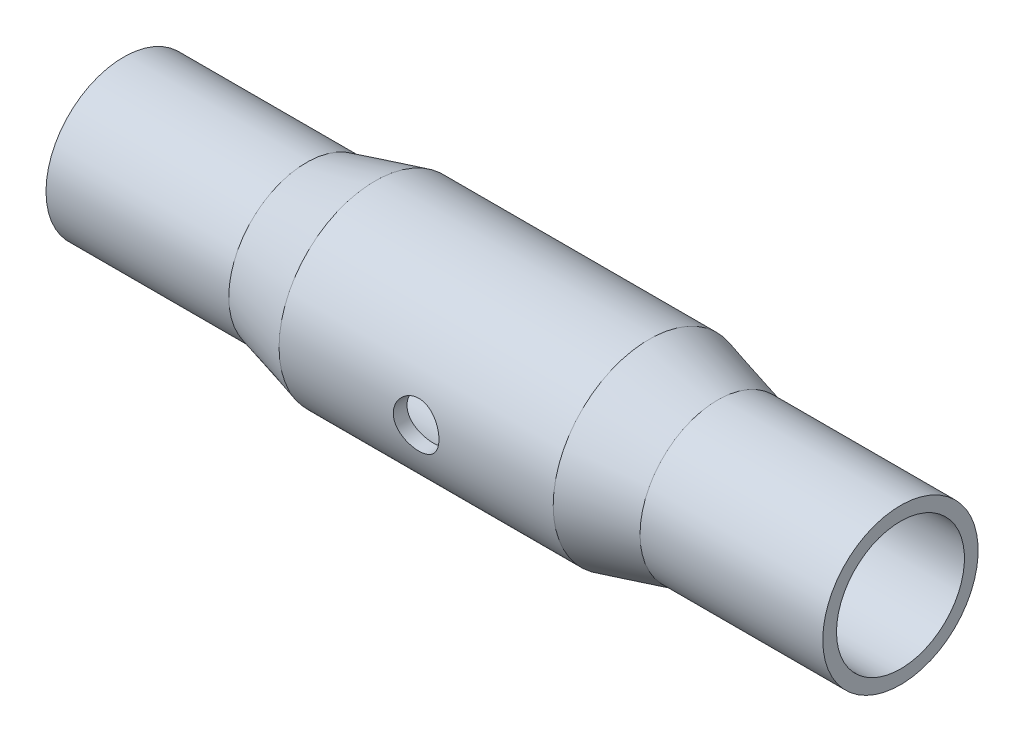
ISO-10303-21;
HEADER;
FILE_DESCRIPTION(('STEP AP214'),'2;1');
FILE_NAME('part.step','',(''),(''),'','','');
FILE_SCHEMA(('AUTOMOTIVE_DESIGN { 1 0 10303 214 1 1 1 1 }'));
ENDSEC;
DATA;
#1=APPLICATION_CONTEXT('core data for automotive mechanical design processes');
#2=APPLICATION_PROTOCOL_DEFINITION('international standard','automotive_design',2000,#1);
#3=PRODUCT_CONTEXT('',#1,'mechanical');
#4=PRODUCT('Part','Part','',(#3));
#5=PRODUCT_RELATED_PRODUCT_CATEGORY('part','',(#4));
#6=PRODUCT_DEFINITION_FORMATION('','',#4);
#7=PRODUCT_DEFINITION_CONTEXT('part definition',#1,'design');
#8=PRODUCT_DEFINITION('design','',#6,#7);
#9=PRODUCT_DEFINITION_SHAPE('','',#8);
#10=(LENGTH_UNIT() NAMED_UNIT(*) SI_UNIT(.MILLI.,.METRE.));
#11=(NAMED_UNIT(*) PLANE_ANGLE_UNIT() SI_UNIT($,.RADIAN.));
#12=(NAMED_UNIT(*) SI_UNIT($,.STERADIAN.) SOLID_ANGLE_UNIT());
#13=UNCERTAINTY_MEASURE_WITH_UNIT(LENGTH_MEASURE(1.E-05),#10,'distance_accuracy_value','');
#14=(GEOMETRIC_REPRESENTATION_CONTEXT(3) GLOBAL_UNCERTAINTY_ASSIGNED_CONTEXT((#13)) GLOBAL_UNIT_ASSIGNED_CONTEXT((#10,
#11,#12)) REPRESENTATION_CONTEXT('',''));
#15=CARTESIAN_POINT('',(0.,0.,0.));
#16=DIRECTION('',(0.,0.,1.));
#17=DIRECTION('',(1.,0.,0.));
#18=AXIS2_PLACEMENT_3D('',#15,#16,#17);
#19=CARTESIAN_POINT('',(-91.895693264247,2.22044604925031E-13,0.));
#20=DIRECTION('',(-1.,0.,0.));
#21=DIRECTION('',(0.,0.,1.));
#22=AXIS2_PLACEMENT_3D('',#19,#20,#21);
#23=CYLINDRICAL_SURFACE('',#22,14.);
#24=CARTESIAN_POINT('',(102.991527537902,4.44089209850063E-13,0.));
#25=DIRECTION('',(-1.,0.,0.));
#26=DIRECTION('',(0.,0.,1.));
#27=AXIS2_PLACEMENT_3D('',#24,#25,#26);
#28=CIRCLE('',#27,14.);
#29=CARTESIAN_POINT('',(102.991527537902,4.44089209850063E-13,14.));
#30=VERTEX_POINT('',#29);
#31=EDGE_CURVE('E129',#30,#30,#28,.T.);
#32=ORIENTED_EDGE('',*,*,#31,.F.);
#33=EDGE_LOOP('',(#32));
#34=FACE_BOUND('',#33,.T.);
#35=CARTESIAN_POINT('',(62.598396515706,0.,0.));
#36=DIRECTION('',(-1.,0.,0.));
#37=DIRECTION('',(0.,0.,1.));
#38=AXIS2_PLACEMENT_3D('',#35,#36,#37);
#39=CIRCLE('',#38,14.);
#40=CARTESIAN_POINT('',(62.598396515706,0.,14.));
#41=VERTEX_POINT('',#40);
#42=EDGE_CURVE('E10',#41,#41,#39,.T.);
#43=ORIENTED_EDGE('',*,*,#42,.T.);
#44=EDGE_LOOP('',(#43));
#45=FACE_BOUND('',#44,.T.);
#46=ADVANCED_FACE('F34',(#34,#45),#23,.F.);
#47=CARTESIAN_POINT('',(47.5983965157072,0.,0.));
#48=DIRECTION('',(-1.,0.,0.));
#49=DIRECTION('',(0.,0.,1.));
#50=AXIS2_PLACEMENT_3D('',#47,#48,#49);
#51=CONICAL_SURFACE('',#50,18.,0.260602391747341);
#52=ORIENTED_EDGE('',*,*,#42,.F.);
#53=EDGE_LOOP('',(#52));
#54=FACE_BOUND('',#53,.T.);
#55=CARTESIAN_POINT('',(47.5983965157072,0.,0.));
#56=DIRECTION('',(-1.,0.,0.));
#57=DIRECTION('',(0.,0.,1.));
#58=AXIS2_PLACEMENT_3D('',#55,#56,#57);
#59=CIRCLE('',#58,18.);
#60=CARTESIAN_POINT('',(47.5983965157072,0.,18.));
#61=VERTEX_POINT('',#60);
#62=EDGE_CURVE('E45',#61,#61,#59,.T.);
#63=ORIENTED_EDGE('',*,*,#62,.T.);
#64=EDGE_LOOP('',(#63));
#65=FACE_BOUND('',#64,.T.);
#66=ADVANCED_FACE('F88',(#54,#65),#51,.F.);
#67=CARTESIAN_POINT('',(-91.895693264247,2.22044604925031E-13,0.));
#68=DIRECTION('',(-1.,0.,0.));
#69=DIRECTION('',(0.,0.,1.));
#70=AXIS2_PLACEMENT_3D('',#67,#68,#69);
#71=CYLINDRICAL_SURFACE('',#70,18.);
#72=CARTESIAN_POINT('',(22.9915275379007,0.,18.));
#73=CARTESIAN_POINT('',(22.9915219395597,0.275205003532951,17.9999963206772));
#74=CARTESIAN_POINT('',(22.9687302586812,0.550468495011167,17.9936269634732));
#75=CARTESIAN_POINT('',(22.8783446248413,1.09303790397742,17.9688380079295));
#76=CARTESIAN_POINT('',(22.8107317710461,1.36034041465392,17.9504133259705));
#77=CARTESIAN_POINT('',(22.633092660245,1.87907979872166,17.9035426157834));
#78=CARTESIAN_POINT('',(22.5231236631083,2.13053756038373,17.8751101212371));
#79=CARTESIAN_POINT('',(22.2641135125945,2.61144278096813,17.8112125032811));
#80=CARTESIAN_POINT('',(22.1150688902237,2.84088828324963,17.7757467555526));
#81=CARTESIAN_POINT('',(21.7782098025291,3.27698713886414,17.7006063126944));
#82=CARTESIAN_POINT('',(21.5895993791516,3.48301245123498,17.6608549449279));
#83=CARTESIAN_POINT('',(21.1806624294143,3.86095274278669,17.5821042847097));
#84=CARTESIAN_POINT('',(20.9603314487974,4.03286292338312,17.5431050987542));
#85=CARTESIAN_POINT('',(20.4890984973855,4.3408323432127,17.4694817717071));
#86=CARTESIAN_POINT('',(20.2376987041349,4.47615499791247,17.4349539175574));
#87=CARTESIAN_POINT('',(19.7145998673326,4.70235828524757,17.3753160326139));
#88=CARTESIAN_POINT('',(19.4429049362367,4.79324789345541,17.3502041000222));
#89=CARTESIAN_POINT('',(18.8939163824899,4.92579697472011,17.3130353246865));
#90=CARTESIAN_POINT('',(18.6169202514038,4.96860147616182,17.3006754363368));
#91=CARTESIAN_POINT('',(18.0594239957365,5.00733708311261,17.2895059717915));
#92=CARTESIAN_POINT('',(17.7789245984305,5.00327776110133,17.2906936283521));
#93=CARTESIAN_POINT('',(17.2314384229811,4.94930685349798,17.3062146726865));
#94=CARTESIAN_POINT('',(16.9643003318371,4.90079609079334,17.3201464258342));
#95=CARTESIAN_POINT('',(16.442113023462,4.76154924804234,17.3589406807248));
#96=CARTESIAN_POINT('',(16.1870648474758,4.67080953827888,17.3838041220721));
#97=CARTESIAN_POINT('',(15.6927186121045,4.44857492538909,17.4420027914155));
#98=CARTESIAN_POINT('',(15.4536480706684,4.3166008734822,17.4754367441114));
#99=CARTESIAN_POINT('',(15.000561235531,4.0159776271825,17.5469580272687));
#100=CARTESIAN_POINT('',(14.7865502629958,3.84732066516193,17.5850463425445));
#101=CARTESIAN_POINT('',(14.3816720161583,3.47102244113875,17.6632428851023));
#102=CARTESIAN_POINT('',(14.1918969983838,3.26220911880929,17.7033748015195));
#103=CARTESIAN_POINT('',(13.8498246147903,2.81522642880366,17.7799279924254));
#104=CARTESIAN_POINT('',(13.6975289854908,2.57705570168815,17.8163490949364));
#105=CARTESIAN_POINT('',(13.4342002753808,2.07633371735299,17.8816335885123));
#106=CARTESIAN_POINT('',(13.3233791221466,1.813665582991,17.9104579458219));
#107=CARTESIAN_POINT('',(13.1477911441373,1.27243995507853,17.9570197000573));
#108=CARTESIAN_POINT('',(13.0830133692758,0.993886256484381,17.9747597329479));
#109=CARTESIAN_POINT('',(13.0030989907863,0.438106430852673,17.9967494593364));
#110=CARTESIAN_POINT('',(12.9864789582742,0.161109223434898,18.0014021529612));
#111=CARTESIAN_POINT('',(12.9992355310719,-0.391719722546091,17.9978592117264));
#112=CARTESIAN_POINT('',(13.028606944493,-0.66755158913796,17.989665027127));
#113=CARTESIAN_POINT('',(13.1313008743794,-1.20482765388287,17.9616106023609));
#114=CARTESIAN_POINT('',(13.2037833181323,-1.46644515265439,17.9419734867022));
#115=CARTESIAN_POINT('',(13.3896550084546,-1.97377247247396,17.8932731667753));
#116=CARTESIAN_POINT('',(13.5030488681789,-2.21948049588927,17.8642088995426));
#117=CARTESIAN_POINT('',(13.7701910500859,-2.6936805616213,17.7989496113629));
#118=CARTESIAN_POINT('',(13.9247296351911,-2.92170824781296,17.7626188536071));
#119=CARTESIAN_POINT('',(14.2687920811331,-3.34911068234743,17.6870190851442));
#120=CARTESIAN_POINT('',(14.4583234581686,-3.54847925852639,17.6477494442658));
#121=CARTESIAN_POINT('',(14.8739333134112,-3.91924810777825,17.5691937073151));
#122=CARTESIAN_POINT('',(15.1009573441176,-4.0895983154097,17.5299443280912));
#123=CARTESIAN_POINT('',(15.5812100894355,-4.38982325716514,17.4571877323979));
#124=CARTESIAN_POINT('',(15.8344378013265,-4.51969953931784,17.4236802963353));
#125=CARTESIAN_POINT('',(16.3587562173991,-4.73432423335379,17.3665919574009));
#126=CARTESIAN_POINT('',(16.6297380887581,-4.81932309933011,17.3429561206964));
#127=CARTESIAN_POINT('',(17.1829263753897,-4.94230609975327,17.3083150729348));
#128=CARTESIAN_POINT('',(17.465129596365,-4.98030351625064,17.2973062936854));
#129=CARTESIAN_POINT('',(18.021950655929,-5.00739439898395,17.2894815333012));
#130=CARTESIAN_POINT('',(18.2964802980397,-4.99818284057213,17.292173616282));
#131=CARTESIAN_POINT('',(18.8399071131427,-4.93508573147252,17.3102854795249));
#132=CARTESIAN_POINT('',(19.1088044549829,-4.8812015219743,17.3257048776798));
#133=CARTESIAN_POINT('',(19.6309964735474,-4.73130896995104,17.3672287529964));
#134=CARTESIAN_POINT('',(19.8844109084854,-4.6356885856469,17.3932346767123));
#135=CARTESIAN_POINT('',(20.3717972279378,-4.40533806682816,17.4529966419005));
#136=CARTESIAN_POINT('',(20.6057658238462,-4.27060133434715,17.4867539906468));
#137=CARTESIAN_POINT('',(21.0556381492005,-3.96082784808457,17.5595524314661));
#138=CARTESIAN_POINT('',(21.2707334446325,-3.78464833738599,17.5987271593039));
#139=CARTESIAN_POINT('',(21.6688570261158,-3.39912610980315,17.6772332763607));
#140=CARTESIAN_POINT('',(21.8518773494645,-3.18977518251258,17.7165647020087));
#141=CARTESIAN_POINT('',(22.1849600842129,-2.73784092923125,17.7920735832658));
#142=CARTESIAN_POINT('',(22.3341340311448,-2.494585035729,17.8281536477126));
#143=CARTESIAN_POINT('',(22.5892400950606,-1.98544793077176,17.8919989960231));
#144=CARTESIAN_POINT('',(22.6951976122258,-1.7195801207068,17.9197691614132));
#145=CARTESIAN_POINT('',(22.8484078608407,-1.21258193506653,17.9606429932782));
#146=CARTESIAN_POINT('',(22.9019466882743,-0.973457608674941,17.9752898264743));
#147=CARTESIAN_POINT('',(22.9735069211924,-0.489570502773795,17.9949693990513));
#148=CARTESIAN_POINT('',(22.9915325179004,-0.244808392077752,18.0000032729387));
#149=CARTESIAN_POINT('',(22.9915275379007,0.,18.));
#150=B_SPLINE_CURVE_WITH_KNOTS('',3,(#72,#73,#74,#75,#76,#77,#78,#79,#80,#81,#82,#83,#84,#85,
#86,#87,#88,#89,#90,#91,#92,#93,#94,#95,#96,#97,#98,#99,#100,#101,#102,#103,#104,#105,#106,#107,
#108,#109,#110,#111,#112,#113,#114,#115,#116,#117,#118,#119,#120,#121,#122,#123,#124,#125,#126,
#127,#128,#129,#130,#131,#132,#133,#134,#135,#136,#137,#138,#139,#140,#141,#142,#143,#144,#145,
#146,#147,#148,#149),.UNSPECIFIED.,.T.,.F.,(4,2,2,2,2,2,2,2,2,2,2,2,2,2,2,2,2,2,2,2,2,2,2,2,2,2,
2,2,2,2,2,2,2,2,2,2,2,2,4),(0.,0.824716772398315,1.64978154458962,2.4737348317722,
3.29776129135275,4.14030497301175,4.98296708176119,5.84150761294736,6.69987464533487,
7.53733727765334,8.37462885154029,9.18640931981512,9.99825957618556,10.8199184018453,
11.6417513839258,12.4927797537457,13.3438475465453,14.1992066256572,15.0543622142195,
15.8828804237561,16.7113051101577,17.5240926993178,18.3369719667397,19.1667579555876,
19.9967223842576,20.8522396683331,21.7077242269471,22.558382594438,23.4088005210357,
24.2289039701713,25.0489827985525,25.8615957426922,26.6743458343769,27.5128765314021,
28.3516151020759,29.210323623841,30.0685267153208,30.802239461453,31.5358656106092),.UNSPECIFIED.);
#151=CARTESIAN_POINT('',(22.9915275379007,0.,18.));
#152=VERTEX_POINT('',#151);
#153=EDGE_CURVE('E79',#152,#152,#150,.T.);
#154=ORIENTED_EDGE('',*,*,#153,.T.);
#155=EDGE_LOOP('',(#154));
#156=FACE_BOUND('',#155,.T.);
#157=CARTESIAN_POINT('',(22.9915275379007,0.,-18.));
#158=CARTESIAN_POINT('',(22.9915219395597,-0.275205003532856,-17.9999963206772));
#159=CARTESIAN_POINT('',(22.9687302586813,-0.550468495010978,-17.9936269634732));
#160=CARTESIAN_POINT('',(22.8783446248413,-1.09303790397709,-17.9688380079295));
#161=CARTESIAN_POINT('',(22.8107317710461,-1.36034041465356,-17.9504133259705));
#162=CARTESIAN_POINT('',(22.633092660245,-1.87907979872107,-17.9035426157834));
#163=CARTESIAN_POINT('',(22.5231236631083,-2.13053756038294,-17.8751101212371));
#164=CARTESIAN_POINT('',(22.2641135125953,-2.61144278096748,-17.8112125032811));
#165=CARTESIAN_POINT('',(22.1150688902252,-2.8408882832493,-17.7757467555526));
#166=CARTESIAN_POINT('',(21.778209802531,-3.27698713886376,-17.7006063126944));
#167=CARTESIAN_POINT('',(21.5895993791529,-3.48301245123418,-17.660854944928));
#168=CARTESIAN_POINT('',(21.1806624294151,-3.86095274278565,-17.5821042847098));
#169=CARTESIAN_POINT('',(20.9603314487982,-4.03286292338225,-17.5431050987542));
#170=CARTESIAN_POINT('',(20.4890984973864,-4.34083234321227,-17.469481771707));
#171=CARTESIAN_POINT('',(20.2376987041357,-4.47615499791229,-17.4349539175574));
#172=CARTESIAN_POINT('',(19.714599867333,-4.70235828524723,-17.3753160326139));
#173=CARTESIAN_POINT('',(19.4429049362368,-4.79324789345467,-17.3502041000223));
#174=CARTESIAN_POINT('',(18.8939163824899,-4.92579697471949,-17.3130353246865));
#175=CARTESIAN_POINT('',(18.6169202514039,-4.96860147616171,-17.3006754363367));
#176=CARTESIAN_POINT('',(18.0594239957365,-5.00733708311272,-17.2895059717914));
#177=CARTESIAN_POINT('',(17.7789245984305,-5.00327776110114,-17.2906936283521));
#178=CARTESIAN_POINT('',(17.2314384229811,-4.94930685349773,-17.3062146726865));
#179=CARTESIAN_POINT('',(16.9643003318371,-4.90079609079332,-17.3201464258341));
#180=CARTESIAN_POINT('',(16.442113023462,-4.76154924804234,-17.3589406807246));
#181=CARTESIAN_POINT('',(16.1870648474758,-4.67080953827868,-17.3838041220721));
#182=CARTESIAN_POINT('',(15.6927186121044,-4.44857492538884,-17.4420027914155));
#183=CARTESIAN_POINT('',(15.4536480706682,-4.31660087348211,-17.4754367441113));
#184=CARTESIAN_POINT('',(15.0005612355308,-4.01597762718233,-17.5469580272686));
#185=CARTESIAN_POINT('',(14.7865502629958,-3.84732066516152,-17.5850463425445));
#186=CARTESIAN_POINT('',(14.3816720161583,-3.47102244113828,-17.6632428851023));
#187=CARTESIAN_POINT('',(14.1918969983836,-3.26220911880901,-17.7033748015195));
#188=CARTESIAN_POINT('',(13.84982461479,-2.81522642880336,-17.7799279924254));
#189=CARTESIAN_POINT('',(13.6975289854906,-2.57705570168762,-17.8163490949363));
#190=CARTESIAN_POINT('',(13.4342002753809,-2.07633371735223,-17.8816335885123));
#191=CARTESIAN_POINT('',(13.3233791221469,-1.81366558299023,-17.9104579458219));
#192=CARTESIAN_POINT('',(13.1477911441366,-1.27243995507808,-17.9570197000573));
#193=CARTESIAN_POINT('',(13.0830133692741,-0.993886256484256,-17.9747597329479));
#194=CARTESIAN_POINT('',(13.0030989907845,-0.438106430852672,-17.9967494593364));
#195=CARTESIAN_POINT('',(12.9864789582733,-0.161109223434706,-18.0014021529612));
#196=CARTESIAN_POINT('',(12.9992355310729,0.391719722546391,-17.9978592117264));
#197=CARTESIAN_POINT('',(13.0286069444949,0.667551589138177,-17.989665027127));
#198=CARTESIAN_POINT('',(13.131300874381,1.20482765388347,-17.9616106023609));
#199=CARTESIAN_POINT('',(13.2037833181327,1.46644515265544,-17.9419734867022));
#200=CARTESIAN_POINT('',(13.389655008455,1.97377247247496,-17.8932731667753));
#201=CARTESIAN_POINT('',(13.5030488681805,2.21948049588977,-17.8642088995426));
#202=CARTESIAN_POINT('',(13.7701910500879,2.69368056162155,-17.7989496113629));
#203=CARTESIAN_POINT('',(13.9247296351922,2.92170824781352,-17.7626188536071));
#204=CARTESIAN_POINT('',(14.2687920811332,3.34911068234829,-17.6870190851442));
#205=CARTESIAN_POINT('',(14.4583234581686,3.54847925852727,-17.6477494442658));
#206=CARTESIAN_POINT('',(14.8739333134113,3.91924810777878,-17.5691937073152));
#207=CARTESIAN_POINT('',(15.1009573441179,4.08959831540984,-17.5299443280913));
#208=CARTESIAN_POINT('',(15.5812100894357,4.38982325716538,-17.457187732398));
#209=CARTESIAN_POINT('',(15.8344378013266,4.51969953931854,-17.4236802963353));
#210=CARTESIAN_POINT('',(16.358756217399,4.73432423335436,-17.3665919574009));
#211=CARTESIAN_POINT('',(16.6297380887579,4.81932309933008,-17.3429561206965));
#212=CARTESIAN_POINT('',(17.1829263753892,4.94230609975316,-17.3083150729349));
#213=CARTESIAN_POINT('',(17.4651295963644,4.98030351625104,-17.2973062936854));
#214=CARTESIAN_POINT('',(18.0219506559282,5.00739439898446,-17.2894815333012));
#215=CARTESIAN_POINT('',(18.2964802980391,4.99818284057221,-17.2921736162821));
#216=CARTESIAN_POINT('',(18.8399071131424,4.93508573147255,-17.310285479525));
#217=CARTESIAN_POINT('',(19.1088044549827,4.88120152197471,-17.3257048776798));
#218=CARTESIAN_POINT('',(19.6309964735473,4.73130896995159,-17.3672287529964));
#219=CARTESIAN_POINT('',(19.8844109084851,4.63568858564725,-17.3932346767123));
#220=CARTESIAN_POINT('',(20.3717972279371,4.40533806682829,-17.4529966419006));
#221=CARTESIAN_POINT('',(20.6057658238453,4.27060133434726,-17.4867539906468));
#222=CARTESIAN_POINT('',(21.0556381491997,3.96082784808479,-17.559552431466));
#223=CARTESIAN_POINT('',(21.270733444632,3.7846483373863,-17.5987271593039));
#224=CARTESIAN_POINT('',(21.6688570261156,3.3991261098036,-17.6772332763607));
#225=CARTESIAN_POINT('',(21.8518773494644,3.18977518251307,-17.7165647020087));
#226=CARTESIAN_POINT('',(22.1849600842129,2.73784092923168,-17.7920735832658));
#227=CARTESIAN_POINT('',(22.3341340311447,2.49458503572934,-17.8281536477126));
#228=CARTESIAN_POINT('',(22.5892400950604,1.98544793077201,-17.8919989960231));
#229=CARTESIAN_POINT('',(22.6951976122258,1.71958012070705,-17.9197691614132));
#230=CARTESIAN_POINT('',(22.8484078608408,1.21258193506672,-17.9606429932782));
#231=CARTESIAN_POINT('',(22.9019466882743,0.973457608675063,-17.9752898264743));
#232=CARTESIAN_POINT('',(22.9735069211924,0.489570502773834,-17.9949693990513));
#233=CARTESIAN_POINT('',(22.9915325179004,0.244808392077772,-18.0000032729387));
#234=CARTESIAN_POINT('',(22.9915275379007,0.,-18.));
#235=B_SPLINE_CURVE_WITH_KNOTS('',3,(#157,#158,#159,#160,#161,#162,#163,#164,#165,#166,#167,
#168,#169,#170,#171,#172,#173,#174,#175,#176,#177,#178,#179,#180,#181,#182,#183,#184,#185,#186,
#187,#188,#189,#190,#191,#192,#193,#194,#195,#196,#197,#198,#199,#200,#201,#202,#203,#204,#205,
#206,#207,#208,#209,#210,#211,#212,#213,#214,#215,#216,#217,#218,#219,#220,#221,#222,#223,#224,
#225,#226,#227,#228,#229,#230,#231,#232,#233,#234),.UNSPECIFIED.,.T.,.F.,(4,2,2,2,2,2,2,2,2,2,2,
2,2,2,2,2,2,2,2,2,2,2,2,2,2,2,2,2,2,2,2,2,2,2,2,2,2,2,4),(0.,0.824716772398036,1.64978154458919,
2.47373483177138,3.29776129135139,4.14030497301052,4.98296708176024,5.84150761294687,
6.69987464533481,7.53733727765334,8.37462885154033,9.18640931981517,9.99825957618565,
10.8199184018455,11.6417513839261,12.492779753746,13.3438475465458,14.1992066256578,
15.0543622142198,15.8828804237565,16.7113051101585,17.5240926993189,18.3369719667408,
19.1667579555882,19.9967223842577,20.8522396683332,21.7077242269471,22.5583825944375,
23.4088005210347,24.2289039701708,25.0489827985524,25.8615957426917,26.674345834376,
27.5128765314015,28.3516151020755,29.2103236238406,30.0685267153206,30.802239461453,
31.5358656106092),.UNSPECIFIED.);
#236=CARTESIAN_POINT('',(22.9915275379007,0.,-18.));
#237=VERTEX_POINT('',#236);
#238=EDGE_CURVE('E74',#237,#237,#235,.T.);
#239=ORIENTED_EDGE('',*,*,#238,.T.);
#240=EDGE_LOOP('',(#239));
#241=FACE_BOUND('',#240,.T.);
#242=ORIENTED_EDGE('',*,*,#62,.F.);
#243=EDGE_LOOP('',(#242));
#244=FACE_BOUND('',#243,.T.);
#245=CARTESIAN_POINT('',(-11.6153414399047,0.,0.));
#246=DIRECTION('',(-1.,0.,0.));
#247=DIRECTION('',(0.,0.,1.));
#248=AXIS2_PLACEMENT_3D('',#245,#246,#247);
#249=CIRCLE('',#248,18.);
#250=CARTESIAN_POINT('',(-11.6153414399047,0.,18.));
#251=VERTEX_POINT('',#250);
#252=EDGE_CURVE('E50',#251,#251,#249,.T.);
#253=ORIENTED_EDGE('',*,*,#252,.T.);
#254=EDGE_LOOP('',(#253));
#255=FACE_BOUND('',#254,.T.);
#256=ADVANCED_FACE('F83',(#156,#241,#244,#255),#71,.F.);
#257=CARTESIAN_POINT('',(-26.6153414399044,0.,0.));
#258=DIRECTION('',(1.,0.,0.));
#259=DIRECTION('',(0.,0.,-1.));
#260=AXIS2_PLACEMENT_3D('',#257,#258,#259);
#261=CONICAL_SURFACE('',#260,14.,0.260602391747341);
#262=ORIENTED_EDGE('',*,*,#252,.F.);
#263=EDGE_LOOP('',(#262));
#264=FACE_BOUND('',#263,.T.);
#265=CARTESIAN_POINT('',(-26.6153414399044,0.,0.));
#266=DIRECTION('',(-1.,0.,0.));
#267=DIRECTION('',(0.,0.,1.));
#268=AXIS2_PLACEMENT_3D('',#265,#266,#267);
#269=CIRCLE('',#268,14.);
#270=CARTESIAN_POINT('',(-26.6153414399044,0.,14.));
#271=VERTEX_POINT('',#270);
#272=EDGE_CURVE('E105',#271,#271,#269,.T.);
#273=ORIENTED_EDGE('',*,*,#272,.T.);
#274=EDGE_LOOP('',(#273));
#275=FACE_BOUND('',#274,.T.);
#276=ADVANCED_FACE('F87',(#264,#275),#261,.F.);
#277=CARTESIAN_POINT('',(-91.895693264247,2.22044604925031E-13,0.));
#278=DIRECTION('',(-1.,0.,0.));
#279=DIRECTION('',(0.,0.,1.));
#280=AXIS2_PLACEMENT_3D('',#277,#278,#279);
#281=CYLINDRICAL_SURFACE('',#280,14.);
#282=ORIENTED_EDGE('',*,*,#272,.F.);
#283=EDGE_LOOP('',(#282));
#284=FACE_BOUND('',#283,.T.);
#285=CARTESIAN_POINT('',(-67.0084724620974,2.22044604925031E-13,0.));
#286=DIRECTION('',(-1.,0.,0.));
#287=DIRECTION('',(0.,0.,1.));
#288=AXIS2_PLACEMENT_3D('',#285,#286,#287);
#289=CIRCLE('',#288,14.);
#290=CARTESIAN_POINT('',(-67.0084724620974,2.22044604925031E-13,14.));
#291=VERTEX_POINT('',#290);
#292=EDGE_CURVE('E107',#291,#291,#289,.T.);
#293=ORIENTED_EDGE('',*,*,#292,.T.);
#294=EDGE_LOOP('',(#293));
#295=FACE_BOUND('',#294,.T.);
#296=ADVANCED_FACE('F169',(#284,#295),#281,.F.);
#297=CARTESIAN_POINT('',(-67.0084724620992,14.0000000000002,0.));
#298=DIRECTION('',(-1.,0.,0.));
#299=DIRECTION('',(0.,0.,1.));
#300=AXIS2_PLACEMENT_3D('',#297,#298,#299);
#301=PLANE('',#300);
#302=CARTESIAN_POINT('',(-67.0084724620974,2.22044604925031E-13,0.));
#303=DIRECTION('',(-1.,0.,0.));
#304=DIRECTION('',(0.,0.,1.));
#305=AXIS2_PLACEMENT_3D('',#302,#303,#304);
#306=CIRCLE('',#305,17.);
#307=CARTESIAN_POINT('',(-67.0084724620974,2.22044604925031E-13,17.));
#308=VERTEX_POINT('',#307);
#309=EDGE_CURVE('E112',#308,#308,#306,.T.);
#310=ORIENTED_EDGE('',*,*,#309,.T.);
#311=EDGE_LOOP('',(#310));
#312=FACE_BOUND('',#311,.T.);
#313=ORIENTED_EDGE('',*,*,#292,.F.);
#314=EDGE_LOOP('',(#313));
#315=FACE_BOUND('',#314,.T.);
#316=ADVANCED_FACE('F163',(#312,#315),#301,.T.);
#317=CARTESIAN_POINT('',(-91.895693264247,2.22044604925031E-13,0.));
#318=DIRECTION('',(-1.,0.,0.));
#319=DIRECTION('',(0.,0.,1.));
#320=AXIS2_PLACEMENT_3D('',#317,#318,#319);
#321=CYLINDRICAL_SURFACE('',#320,17.);
#322=CARTESIAN_POINT('',(-27.0084724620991,0.,0.));
#323=DIRECTION('',(-1.,0.,0.));
#324=DIRECTION('',(0.,0.,1.));
#325=AXIS2_PLACEMENT_3D('',#322,#323,#324);
#326=CIRCLE('',#325,17.);
#327=CARTESIAN_POINT('',(-27.0084724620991,0.,17.));
#328=VERTEX_POINT('',#327);
#329=EDGE_CURVE('E115',#328,#328,#326,.T.);
#330=ORIENTED_EDGE('',*,*,#329,.T.);
#331=EDGE_LOOP('',(#330));
#332=FACE_BOUND('',#331,.T.);
#333=ORIENTED_EDGE('',*,*,#309,.F.);
#334=EDGE_LOOP('',(#333));
#335=FACE_BOUND('',#334,.T.);
#336=ADVANCED_FACE('F158',(#332,#335),#321,.T.);
#337=CARTESIAN_POINT('',(-27.0084724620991,0.,0.));
#338=DIRECTION('',(1.,0.,0.));
#339=DIRECTION('',(0.,0.,-1.));
#340=AXIS2_PLACEMENT_3D('',#337,#338,#339);
#341=CONICAL_SURFACE('',#340,17.,0.260602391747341);
#342=CARTESIAN_POINT('',(-12.0084724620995,0.,0.));
#343=DIRECTION('',(-1.,0.,0.));
#344=DIRECTION('',(0.,0.,1.));
#345=AXIS2_PLACEMENT_3D('',#342,#343,#344);
#346=CIRCLE('',#345,21.);
#347=CARTESIAN_POINT('',(-12.0084724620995,0.,21.));
#348=VERTEX_POINT('',#347);
#349=EDGE_CURVE('E118',#348,#348,#346,.T.);
#350=ORIENTED_EDGE('',*,*,#349,.T.);
#351=EDGE_LOOP('',(#350));
#352=FACE_BOUND('',#351,.T.);
#353=ORIENTED_EDGE('',*,*,#329,.F.);
#354=EDGE_LOOP('',(#353));
#355=FACE_BOUND('',#354,.T.);
#356=ADVANCED_FACE('F150',(#352,#355),#341,.T.);
#357=CARTESIAN_POINT('',(-91.895693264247,2.22044604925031E-13,0.));
#358=DIRECTION('',(-1.,0.,0.));
#359=DIRECTION('',(0.,0.,1.));
#360=AXIS2_PLACEMENT_3D('',#357,#358,#359);
#361=CYLINDRICAL_SURFACE('',#360,21.);
#362=CARTESIAN_POINT('',(22.9915275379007,0.,21.));
#363=CARTESIAN_POINT('',(22.9915190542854,0.27667227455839,20.9999950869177));
#364=CARTESIAN_POINT('',(22.9684858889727,0.553442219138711,20.9944774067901));
#365=CARTESIAN_POINT('',(22.8770829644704,1.09907770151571,20.9730002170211));
#366=CARTESIAN_POINT('',(22.8086848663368,1.36793818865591,20.9570341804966));
#367=CARTESIAN_POINT('',(22.6288495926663,1.88979410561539,20.9164321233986));
#368=CARTESIAN_POINT('',(22.5174614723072,2.14280723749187,20.891805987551));
#369=CARTESIAN_POINT('',(22.2549741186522,2.6265522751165,20.8365202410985));
#370=CARTESIAN_POINT('',(22.1038744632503,2.85728394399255,20.8058605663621));
#371=CARTESIAN_POINT('',(21.7632488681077,3.29425969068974,20.7412034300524));
#372=CARTESIAN_POINT('',(21.5731174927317,3.50002481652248,20.7071583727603));
#373=CARTESIAN_POINT('',(21.1611232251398,3.8770675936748,20.639891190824));
#374=CARTESIAN_POINT('',(20.9392570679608,4.04834169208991,20.6066691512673));
#375=CARTESIAN_POINT('',(20.4664425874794,4.35373775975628,20.5443340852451));
#376=CARTESIAN_POINT('',(20.2151461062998,4.48733420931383,20.5152817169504));
#377=CARTESIAN_POINT('',(19.6928603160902,4.71020659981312,20.4652654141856));
#378=CARTESIAN_POINT('',(19.4218738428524,4.7994889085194,20.4443003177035));
#379=CARTESIAN_POINT('',(18.8731397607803,4.92958478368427,20.4133198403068));
#380=CARTESIAN_POINT('',(18.5956062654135,4.97125443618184,20.4031113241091));
#381=CARTESIAN_POINT('',(18.0373145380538,5.00760694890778,20.3942210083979));
#382=CARTESIAN_POINT('',(17.7565567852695,5.00229670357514,20.3955375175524));
#383=CARTESIAN_POINT('',(17.2062682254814,4.94552551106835,20.4093743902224));
#384=CARTESIAN_POINT('',(16.9366261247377,4.89507437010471,20.4216495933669));
#385=CARTESIAN_POINT('',(16.4097470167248,4.75106000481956,20.4556312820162));
#386=CARTESIAN_POINT('',(16.152510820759,4.65749396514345,20.4773383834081));
#387=CARTESIAN_POINT('',(15.6549861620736,4.42901918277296,20.5279695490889));
#388=CARTESIAN_POINT('',(15.4148768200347,4.29373539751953,20.5569586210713));
#389=CARTESIAN_POINT('',(14.9604004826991,3.98592814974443,20.6188494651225));
#390=CARTESIAN_POINT('',(14.746037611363,3.81339873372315,20.6517518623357));
#391=CARTESIAN_POINT('',(14.3433413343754,3.43072154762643,20.7188021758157));
#392=CARTESIAN_POINT('',(14.1558210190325,3.21971896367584,20.7529603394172));
#393=CARTESIAN_POINT('',(13.8186810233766,2.76886002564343,20.8179059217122));
#394=CARTESIAN_POINT('',(13.6690622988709,2.52900294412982,20.8486932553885));
#395=CARTESIAN_POINT('',(13.4117132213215,2.02615010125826,20.9035591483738));
#396=CARTESIAN_POINT('',(13.3041048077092,1.76308965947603,20.9276181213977));
#397=CARTESIAN_POINT('',(13.1348556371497,1.2219158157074,20.9661730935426));
#398=CARTESIAN_POINT('',(13.0732069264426,0.943805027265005,20.9806707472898));
#399=CARTESIAN_POINT('',(12.9988454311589,0.387385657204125,20.9982284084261));
#400=CARTESIAN_POINT('',(12.9850240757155,0.109233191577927,21.0015474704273));
#401=CARTESIAN_POINT('',(13.0036832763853,-0.445408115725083,20.9971071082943));
#402=CARTESIAN_POINT('',(13.0361600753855,-0.721897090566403,20.9893485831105));
#403=CARTESIAN_POINT('',(13.1455774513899,-1.26158148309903,20.9637898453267));
#404=CARTESIAN_POINT('',(13.2219224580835,-1.52490459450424,20.9461242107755));
#405=CARTESIAN_POINT('',(13.4162364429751,-2.0349992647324,20.9027358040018));
#406=CARTESIAN_POINT('',(13.5342093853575,-2.28176924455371,20.8770122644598));
#407=CARTESIAN_POINT('',(13.8106421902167,-2.75623238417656,20.8197328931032));
#408=CARTESIAN_POINT('',(13.9697349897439,-2.98354580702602,20.7880882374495));
#409=CARTESIAN_POINT('',(14.3230729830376,-3.40864470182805,20.7226320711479));
#410=CARTESIAN_POINT('',(14.5173236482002,-3.60642556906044,20.6888202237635));
#411=CARTESIAN_POINT('',(14.9405888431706,-3.97134130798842,20.6219225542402));
#412=CARTESIAN_POINT('',(15.170276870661,-4.13770216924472,20.5888692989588));
#413=CARTESIAN_POINT('',(15.6549734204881,-4.42950564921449,20.52807307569));
#414=CARTESIAN_POINT('',(15.9099808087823,-4.55495009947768,20.5003298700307));
#415=CARTESIAN_POINT('',(16.4366858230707,-4.76045016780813,20.4535871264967));
#416=CARTESIAN_POINT('',(16.708274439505,-4.84077290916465,20.4345362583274));
#417=CARTESIAN_POINT('',(17.2616165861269,-4.95448974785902,20.4072662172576));
#418=CARTESIAN_POINT('',(17.5433681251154,-4.98789298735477,20.3990449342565));
#419=CARTESIAN_POINT('',(18.1011919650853,-5.00637908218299,20.3945149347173));
#420=CARTESIAN_POINT('',(18.377221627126,-4.99269483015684,20.3979022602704));
#421=CARTESIAN_POINT('',(18.9229176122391,-4.92019018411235,20.4155111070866));
#422=CARTESIAN_POINT('',(19.1925840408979,-4.86137053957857,20.4297324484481));
#423=CARTESIAN_POINT('',(19.716701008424,-4.70090846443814,20.4672456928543));
#424=CARTESIAN_POINT('',(19.9712195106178,-4.59947686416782,20.4904928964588));
#425=CARTESIAN_POINT('',(20.4597982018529,-4.35684092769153,20.5434488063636));
#426=CARTESIAN_POINT('',(20.6938558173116,-4.21563159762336,20.573158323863));
#427=CARTESIAN_POINT('',(21.1408745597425,-3.89349523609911,20.6365744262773));
#428=CARTESIAN_POINT('',(21.3532014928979,-3.71170340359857,20.6703592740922));
#429=CARTESIAN_POINT('',(21.7447377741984,-3.31527481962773,20.7376300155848));
#430=CARTESIAN_POINT('',(21.9239393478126,-3.10063037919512,20.7711158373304));
#431=CARTESIAN_POINT('',(22.246916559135,-2.64044421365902,20.8346538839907));
#432=CARTESIAN_POINT('',(22.3900792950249,-2.3944629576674,20.8646425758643));
#433=CARTESIAN_POINT('',(22.6327945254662,-1.88124484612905,20.9171515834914));
#434=CARTESIAN_POINT('',(22.7323804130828,-1.61402445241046,20.9396776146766));
#435=CARTESIAN_POINT('',(22.8691444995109,-1.12247311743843,20.9711168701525));
#436=CARTESIAN_POINT('',(22.9149436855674,-0.900618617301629,20.981876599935));
#437=CARTESIAN_POINT('',(22.9761377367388,-0.452531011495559,20.9963199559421));
#438=CARTESIAN_POINT('',(22.9915344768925,-0.226298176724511,21.0000040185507));
#439=CARTESIAN_POINT('',(22.9915275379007,0.,21.));
#440=B_SPLINE_CURVE_WITH_KNOTS('',3,(#362,#363,#364,#365,#366,#367,#368,#369,#370,#371,#372,
#373,#374,#375,#376,#377,#378,#379,#380,#381,#382,#383,#384,#385,#386,#387,#388,#389,#390,#391,
#392,#393,#394,#395,#396,#397,#398,#399,#400,#401,#402,#403,#404,#405,#406,#407,#408,#409,#410,
#411,#412,#413,#414,#415,#416,#417,#418,#419,#420,#421,#422,#423,#424,#425,#426,#427,#428,#429,
#430,#431,#432,#433,#434,#435,#436,#437,#438,#439),.UNSPECIFIED.,.T.,.F.,(4,2,2,2,2,2,2,2,2,2,2,
2,2,2,2,2,2,2,2,2,2,2,2,2,2,2,2,2,2,2,2,2,2,2,2,2,2,2,4),(0.,0.829187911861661,1.65889429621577,
2.48765670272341,3.31642791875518,4.15918514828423,5.00202914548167,5.85610518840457,
6.7100584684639,7.5484031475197,8.38662479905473,9.20655158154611,10.0265319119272,
10.8541100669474,11.681820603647,12.5308602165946,13.3799212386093,14.2314287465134,
15.0827888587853,15.9142784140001,16.7457004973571,17.5660929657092,18.3865635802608,
19.2205051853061,20.0545766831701,20.9070840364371,21.7595532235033,22.606921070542,
23.454123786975,24.2793148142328,25.1044921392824,25.9256339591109,26.7468789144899,
27.5876572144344,28.4286325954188,29.2830678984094,30.1368472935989,30.8151056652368,
31.4933222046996),.UNSPECIFIED.);
#441=CARTESIAN_POINT('',(22.9915275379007,0.,21.));
#442=VERTEX_POINT('',#441);
#443=EDGE_CURVE('E37',#442,#442,#440,.T.);
#444=ORIENTED_EDGE('',*,*,#443,.F.);
#445=EDGE_LOOP('',(#444));
#446=FACE_BOUND('',#445,.T.);
#447=CARTESIAN_POINT('',(22.9915275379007,0.,-21.));
#448=CARTESIAN_POINT('',(22.9915190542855,-0.276672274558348,-20.9999950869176));
#449=CARTESIAN_POINT('',(22.968485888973,-0.553442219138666,-20.9944774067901));
#450=CARTESIAN_POINT('',(22.8770829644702,-1.09907770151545,-20.9730002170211));
#451=CARTESIAN_POINT('',(22.8086848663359,-1.36793818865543,-20.9570341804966));
#452=CARTESIAN_POINT('',(22.6288495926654,-1.88979410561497,-20.9164321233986));
#453=CARTESIAN_POINT('',(22.5174614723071,-2.14280723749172,-20.8918059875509));
#454=CARTESIAN_POINT('',(22.2549741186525,-2.62655227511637,-20.8365202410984));
#455=CARTESIAN_POINT('',(22.1038744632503,-2.85728394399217,-20.8058605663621));
#456=CARTESIAN_POINT('',(21.7632488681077,-3.2942596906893,-20.7412034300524));
#457=CARTESIAN_POINT('',(21.5731174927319,-3.50002481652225,-20.7071583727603));
#458=CARTESIAN_POINT('',(21.16112322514,-3.87706759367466,-20.639891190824));
#459=CARTESIAN_POINT('',(20.9392570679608,-4.04834169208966,-20.6066691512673));
#460=CARTESIAN_POINT('',(20.4664425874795,-4.35373775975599,-20.5443340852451));
#461=CARTESIAN_POINT('',(20.2151461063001,-4.48733420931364,-20.5152817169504));
#462=CARTESIAN_POINT('',(19.6928603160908,-4.71020659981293,-20.4652654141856));
#463=CARTESIAN_POINT('',(19.4218738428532,-4.79948890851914,-20.4443003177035));
#464=CARTESIAN_POINT('',(18.8731397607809,-4.9295847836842,-20.4133198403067));
#465=CARTESIAN_POINT('',(18.5956062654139,-4.97125443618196,-20.403111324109));
#466=CARTESIAN_POINT('',(18.0373145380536,-5.00760694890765,-20.3942210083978));
#467=CARTESIAN_POINT('',(17.756556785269,-5.00229670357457,-20.3955375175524));
#468=CARTESIAN_POINT('',(17.2062682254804,-4.94552551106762,-20.4093743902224));
#469=CARTESIAN_POINT('',(16.9366261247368,-4.8950743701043,-20.4216495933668));
#470=CARTESIAN_POINT('',(16.4097470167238,-4.75106000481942,-20.4556312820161));
#471=CARTESIAN_POINT('',(16.1525108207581,-4.65749396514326,-20.4773383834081));
#472=CARTESIAN_POINT('',(15.654986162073,-4.42901918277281,-20.5279695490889));
#473=CARTESIAN_POINT('',(15.4148768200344,-4.29373539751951,-20.5569586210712));
#474=CARTESIAN_POINT('',(14.9604004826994,-3.98592814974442,-20.6188494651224));
#475=CARTESIAN_POINT('',(14.7460376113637,-3.813398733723,-20.6517518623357));
#476=CARTESIAN_POINT('',(14.3433413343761,-3.43072154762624,-20.7188021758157));
#477=CARTESIAN_POINT('',(14.1558210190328,-3.2197189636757,-20.7529603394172));
#478=CARTESIAN_POINT('',(13.818681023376,-2.76886002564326,-20.8179059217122));
#479=CARTESIAN_POINT('',(13.66906229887,-2.5290029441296,-20.8486932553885));
#480=CARTESIAN_POINT('',(13.4117132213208,-2.02615010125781,-20.9035591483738));
#481=CARTESIAN_POINT('',(13.3041048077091,-1.76308965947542,-20.9276181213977));
#482=CARTESIAN_POINT('',(13.1348556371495,-1.22191581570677,-20.9661730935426));
#483=CARTESIAN_POINT('',(13.0732069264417,-0.94380502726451,-20.9806707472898));
#484=CARTESIAN_POINT('',(12.9988454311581,-0.387385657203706,-20.9982284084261));
#485=CARTESIAN_POINT('',(12.9850240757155,-0.109233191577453,-21.0015474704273));
#486=CARTESIAN_POINT('',(13.0036832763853,0.445408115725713,-20.9971071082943));
#487=CARTESIAN_POINT('',(13.0361600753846,0.721897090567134,-20.9893485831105));
#488=CARTESIAN_POINT('',(13.1455774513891,1.26158148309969,-20.9637898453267));
#489=CARTESIAN_POINT('',(13.2219224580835,1.52490459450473,-20.9461242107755));
#490=CARTESIAN_POINT('',(13.4162364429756,2.03499926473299,-20.9027358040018));
#491=CARTESIAN_POINT('',(13.5342093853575,2.28176924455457,-20.8770122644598));
#492=CARTESIAN_POINT('',(13.8106421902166,2.75623238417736,-20.8197328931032));
#493=CARTESIAN_POINT('',(13.9697349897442,2.98354580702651,-20.7880882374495));
#494=CARTESIAN_POINT('',(14.323072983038,3.40864470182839,-20.7226320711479));
#495=CARTESIAN_POINT('',(14.5173236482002,3.60642556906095,-20.6888202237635));
#496=CARTESIAN_POINT('',(14.9405888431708,3.97134130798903,-20.6219225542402));
#497=CARTESIAN_POINT('',(15.1702768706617,4.13770216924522,-20.5888692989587));
#498=CARTESIAN_POINT('',(15.6549734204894,4.42950564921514,-20.5280730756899));
#499=CARTESIAN_POINT('',(15.9099808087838,4.55495009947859,-20.5003298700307));
#500=CARTESIAN_POINT('',(16.4366858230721,4.76045016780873,-20.4535871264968));
#501=CARTESIAN_POINT('',(16.708274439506,4.8407729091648,-20.4345362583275));
#502=CARTESIAN_POINT('',(17.261616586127,4.9544897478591,-20.4072662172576));
#503=CARTESIAN_POINT('',(17.5433681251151,4.98789298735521,-20.3990449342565));
#504=CARTESIAN_POINT('',(18.1011919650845,5.00637908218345,-20.3945149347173));
#505=CARTESIAN_POINT('',(18.3772216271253,4.99269483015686,-20.3979022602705));
#506=CARTESIAN_POINT('',(18.9229176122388,4.92019018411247,-20.4155111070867));
#507=CARTESIAN_POINT('',(19.1925840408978,4.86137053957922,-20.4297324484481));
#508=CARTESIAN_POINT('',(19.7167010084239,4.70090846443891,-20.4672456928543));
#509=CARTESIAN_POINT('',(19.9712195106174,4.59947686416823,-20.4904928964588));
#510=CARTESIAN_POINT('',(20.4597982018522,4.35684092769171,-20.5434488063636));
#511=CARTESIAN_POINT('',(20.6938558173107,4.21563159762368,-20.5731583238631));
#512=CARTESIAN_POINT('',(21.1408745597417,3.89349523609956,-20.6365744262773));
#513=CARTESIAN_POINT('',(21.3532014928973,3.71170340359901,-20.6703592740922));
#514=CARTESIAN_POINT('',(21.7447377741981,3.31527481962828,-20.7376300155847));
#515=CARTESIAN_POINT('',(21.9239393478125,3.10063037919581,-20.7711158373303));
#516=CARTESIAN_POINT('',(22.2469165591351,2.64044421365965,-20.8346538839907));
#517=CARTESIAN_POINT('',(22.3900792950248,2.39446295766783,-20.8646425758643));
#518=CARTESIAN_POINT('',(22.632794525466,1.88124484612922,-20.9171515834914));
#519=CARTESIAN_POINT('',(22.7323804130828,1.61402445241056,-20.9396776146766));
#520=CARTESIAN_POINT('',(22.8691444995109,1.12247311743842,-20.9711168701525));
#521=CARTESIAN_POINT('',(22.9149436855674,0.900618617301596,-20.981876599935));
#522=CARTESIAN_POINT('',(22.9761377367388,0.452531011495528,-20.9963199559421));
#523=CARTESIAN_POINT('',(22.9915344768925,0.226298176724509,-21.0000040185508));
#524=CARTESIAN_POINT('',(22.9915275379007,0.,-21.));
#525=B_SPLINE_CURVE_WITH_KNOTS('',3,(#447,#448,#449,#450,#451,#452,#453,#454,#455,#456,#457,
#458,#459,#460,#461,#462,#463,#464,#465,#466,#467,#468,#469,#470,#471,#472,#473,#474,#475,#476,
#477,#478,#479,#480,#481,#482,#483,#484,#485,#486,#487,#488,#489,#490,#491,#492,#493,#494,#495,
#496,#497,#498,#499,#500,#501,#502,#503,#504,#505,#506,#507,#508,#509,#510,#511,#512,#513,#514,
#515,#516,#517,#518,#519,#520,#521,#522,#523,#524),.UNSPECIFIED.,.T.,.F.,(4,2,2,2,2,2,2,2,2,2,2,
2,2,2,2,2,2,2,2,2,2,2,2,2,2,2,2,2,2,2,2,2,2,2,2,2,2,2,4),(0.,0.829187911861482,1.65889429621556,
2.48765670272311,3.31642791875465,4.15918514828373,5.00202914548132,5.85610518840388,
6.71005846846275,7.54840314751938,8.3866247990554,9.20655158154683,10.0265319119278,
10.8541100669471,11.681820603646,12.5308602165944,13.3799212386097,14.2314287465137,
15.0827888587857,15.9142784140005,16.7457004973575,17.5660929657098,18.3865635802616,
19.2205051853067,20.0545766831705,20.9070840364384,21.7595532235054,22.6069210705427,
23.4541237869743,24.2793148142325,25.1044921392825,25.9256339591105,26.7468789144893,
27.587657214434,28.4286325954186,29.2830678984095,30.1368472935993,30.8151056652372,
31.4933222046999),.UNSPECIFIED.);
#526=CARTESIAN_POINT('',(22.9915275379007,0.,-21.));
#527=VERTEX_POINT('',#526);
#528=EDGE_CURVE('E53',#527,#527,#525,.T.);
#529=ORIENTED_EDGE('',*,*,#528,.F.);
#530=EDGE_LOOP('',(#529));
#531=FACE_BOUND('',#530,.T.);
#532=CARTESIAN_POINT('',(47.9915275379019,0.,0.));
#533=DIRECTION('',(-1.,0.,0.));
#534=DIRECTION('',(0.,0.,1.));
#535=AXIS2_PLACEMENT_3D('',#532,#533,#534);
#536=CIRCLE('',#535,21.);
#537=CARTESIAN_POINT('',(47.9915275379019,0.,21.));
#538=VERTEX_POINT('',#537);
#539=EDGE_CURVE('E121',#538,#538,#536,.T.);
#540=ORIENTED_EDGE('',*,*,#539,.T.);
#541=EDGE_LOOP('',(#540));
#542=FACE_BOUND('',#541,.T.);
#543=ORIENTED_EDGE('',*,*,#349,.F.);
#544=EDGE_LOOP('',(#543));
#545=FACE_BOUND('',#544,.T.);
#546=ADVANCED_FACE('F57',(#446,#531,#542,#545),#361,.T.);
#547=CARTESIAN_POINT('',(47.9915275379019,0.,0.));
#548=DIRECTION('',(-1.,0.,0.));
#549=DIRECTION('',(0.,0.,1.));
#550=AXIS2_PLACEMENT_3D('',#547,#548,#549);
#551=CONICAL_SURFACE('',#550,21.,0.260602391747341);
#552=CARTESIAN_POINT('',(62.9915275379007,0.,0.));
#553=DIRECTION('',(-1.,0.,0.));
#554=DIRECTION('',(0.,0.,1.));
#555=AXIS2_PLACEMENT_3D('',#552,#553,#554);
#556=CIRCLE('',#555,17.);
#557=CARTESIAN_POINT('',(62.9915275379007,0.,17.));
#558=VERTEX_POINT('',#557);
#559=EDGE_CURVE('E124',#558,#558,#556,.T.);
#560=ORIENTED_EDGE('',*,*,#559,.T.);
#561=EDGE_LOOP('',(#560));
#562=FACE_BOUND('',#561,.T.);
#563=ORIENTED_EDGE('',*,*,#539,.F.);
#564=EDGE_LOOP('',(#563));
#565=FACE_BOUND('',#564,.T.);
#566=ADVANCED_FACE('F149',(#562,#565),#551,.T.);
#567=CARTESIAN_POINT('',(-91.895693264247,2.22044604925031E-13,0.));
#568=DIRECTION('',(-1.,0.,0.));
#569=DIRECTION('',(0.,0.,1.));
#570=AXIS2_PLACEMENT_3D('',#567,#568,#569);
#571=CYLINDRICAL_SURFACE('',#570,17.);
#572=CARTESIAN_POINT('',(102.991527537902,4.44089209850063E-13,0.));
#573=DIRECTION('',(-1.,0.,0.));
#574=DIRECTION('',(0.,0.,1.));
#575=AXIS2_PLACEMENT_3D('',#572,#573,#574);
#576=CIRCLE('',#575,17.);
#577=CARTESIAN_POINT('',(102.991527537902,4.44089209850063E-13,17.));
#578=VERTEX_POINT('',#577);
#579=EDGE_CURVE('E127',#578,#578,#576,.T.);
#580=ORIENTED_EDGE('',*,*,#579,.T.);
#581=EDGE_LOOP('',(#580));
#582=FACE_BOUND('',#581,.T.);
#583=ORIENTED_EDGE('',*,*,#559,.F.);
#584=EDGE_LOOP('',(#583));
#585=FACE_BOUND('',#584,.T.);
#586=ADVANCED_FACE('F144',(#582,#585),#571,.T.);
#587=CARTESIAN_POINT('',(102.991527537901,16.9999999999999,0.));
#588=DIRECTION('',(1.,0.,0.));
#589=DIRECTION('',(0.,0.,-1.));
#590=AXIS2_PLACEMENT_3D('',#587,#588,#589);
#591=PLANE('',#590);
#592=ORIENTED_EDGE('',*,*,#31,.T.);
#593=EDGE_LOOP('',(#592));
#594=FACE_BOUND('',#593,.T.);
#595=ORIENTED_EDGE('',*,*,#579,.F.);
#596=EDGE_LOOP('',(#595));
#597=FACE_BOUND('',#596,.T.);
#598=ADVANCED_FACE('F67',(#594,#597),#591,.T.);
#599=CARTESIAN_POINT('',(17.9915275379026,0.,-30.));
#600=DIRECTION('',(0.,0.,1.));
#601=DIRECTION('',(1.,0.,0.));
#602=AXIS2_PLACEMENT_3D('',#599,#600,#601);
#603=CYLINDRICAL_SURFACE('',#602,4.99999999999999);
#604=ORIENTED_EDGE('',*,*,#528,.T.);
#605=EDGE_LOOP('',(#604));
#606=FACE_BOUND('',#605,.T.);
#607=ORIENTED_EDGE('',*,*,#238,.F.);
#608=EDGE_LOOP('',(#607));
#609=FACE_BOUND('',#608,.T.);
#610=ADVANCED_FACE('F65',(#606,#609),#603,.F.);
#611=ORIENTED_EDGE('',*,*,#443,.T.);
#612=EDGE_LOOP('',(#611));
#613=FACE_BOUND('',#612,.T.);
#614=ORIENTED_EDGE('',*,*,#153,.F.);
#615=EDGE_LOOP('',(#614));
#616=FACE_BOUND('',#615,.T.);
#617=ADVANCED_FACE('F61',(#613,#616),#603,.F.);
#618=CLOSED_SHELL('',(#46,#66,#256,#276,#296,#316,#336,#356,#546,#566,#586,#598,#610,#617));
#619=MANIFOLD_SOLID_BREP('B2',#618);
#620=ADVANCED_BREP_SHAPE_REPRESENTATION('',(#18,#619),#14);
#621=SHAPE_DEFINITION_REPRESENTATION(#9,#620);
ENDSEC;
END-ISO-10303-21;
